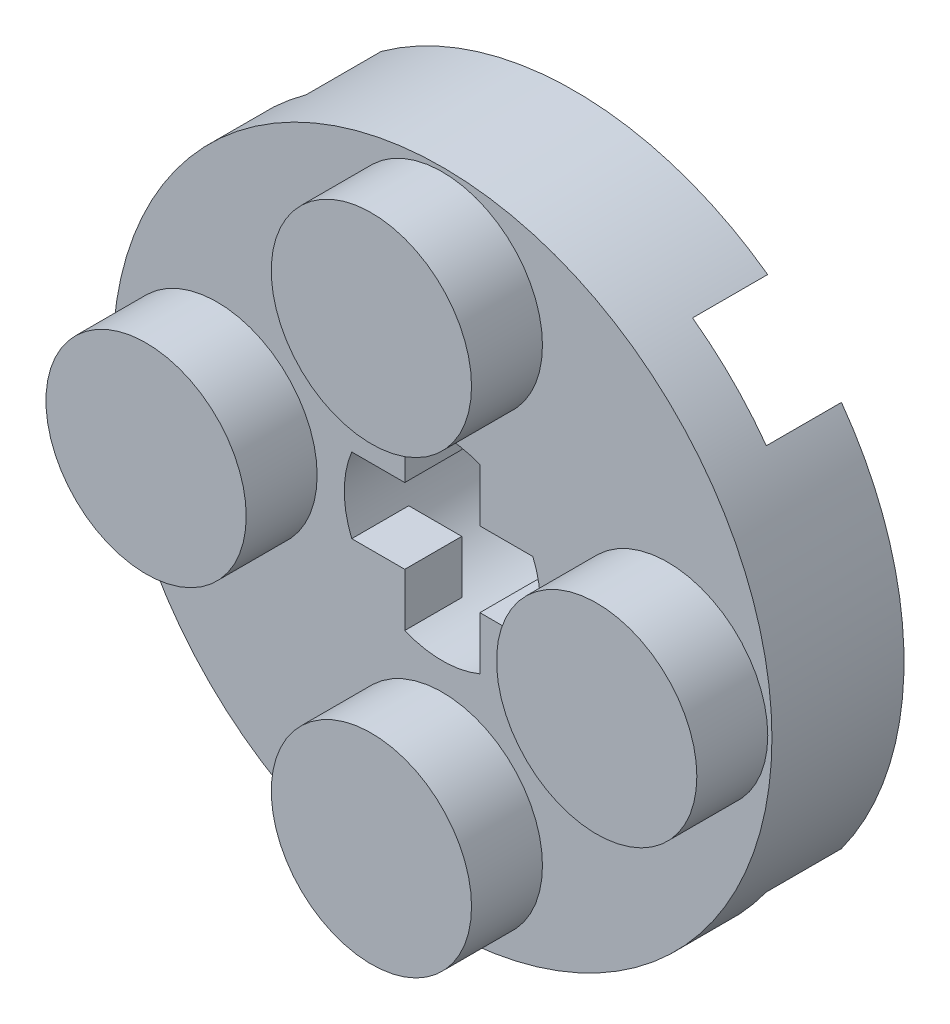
ISO-10303-21;
HEADER;
FILE_DESCRIPTION(('STEP AP214'),'2;1');
FILE_NAME('part.step','',(''),(''),'','','');
FILE_SCHEMA(('AUTOMOTIVE_DESIGN { 1 0 10303 214 1 1 1 1 }'));
ENDSEC;
DATA;
#1=APPLICATION_CONTEXT('core data for automotive mechanical design processes');
#2=APPLICATION_PROTOCOL_DEFINITION('international standard','automotive_design',2000,#1);
#3=PRODUCT_CONTEXT('',#1,'mechanical');
#4=PRODUCT('Part','Part','',(#3));
#5=PRODUCT_RELATED_PRODUCT_CATEGORY('part','',(#4));
#6=PRODUCT_DEFINITION_FORMATION('','',#4);
#7=PRODUCT_DEFINITION_CONTEXT('part definition',#1,'design');
#8=PRODUCT_DEFINITION('design','',#6,#7);
#9=PRODUCT_DEFINITION_SHAPE('','',#8);
#10=(LENGTH_UNIT() NAMED_UNIT(*) SI_UNIT(.MILLI.,.METRE.));
#11=(NAMED_UNIT(*) PLANE_ANGLE_UNIT() SI_UNIT($,.RADIAN.));
#12=(NAMED_UNIT(*) SI_UNIT($,.STERADIAN.) SOLID_ANGLE_UNIT());
#13=UNCERTAINTY_MEASURE_WITH_UNIT(LENGTH_MEASURE(1.E-05),#10,'distance_accuracy_value','');
#14=(GEOMETRIC_REPRESENTATION_CONTEXT(3) GLOBAL_UNCERTAINTY_ASSIGNED_CONTEXT((#13)) GLOBAL_UNIT_ASSIGNED_CONTEXT((#10,
#11,#12)) REPRESENTATION_CONTEXT('',''));
#15=CARTESIAN_POINT('',(0.,0.,0.));
#16=DIRECTION('',(0.,0.,1.));
#17=DIRECTION('',(1.,0.,0.));
#18=AXIS2_PLACEMENT_3D('',#15,#16,#17);
#19=CARTESIAN_POINT('',(6.4,6.4,1.8));
#20=DIRECTION('',(0.,0.,-1.));
#21=DIRECTION('',(-1.,0.,0.));
#22=AXIS2_PLACEMENT_3D('',#19,#20,#21);
#23=PLANE('',#22);
#24=CARTESIAN_POINT('',(0.,0.,1.8));
#25=DIRECTION('',(0.,0.,-1.));
#26=DIRECTION('',(-1.,0.,0.));
#27=AXIS2_PLACEMENT_3D('',#24,#25,#26);
#28=CIRCLE('',#27,7.9);
#29=CARTESIAN_POINT('',(-6.4,4.63141447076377,1.8));
#30=VERTEX_POINT('',#29);
#31=CARTESIAN_POINT('',(-4.63141447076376,6.4,1.8));
#32=VERTEX_POINT('',#31);
#33=EDGE_CURVE('E331',#30,#32,#28,.T.);
#34=ORIENTED_EDGE('',*,*,#33,.T.);
#35=DIRECTION('',(1.,0.,0.));
#36=VECTOR('',#35,1.);
#37=CARTESIAN_POINT('',(-6.4,6.4,1.8));
#38=LINE('',#37,#36);
#39=CARTESIAN_POINT('',(4.63141447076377,6.4,1.8));
#40=VERTEX_POINT('',#39);
#41=EDGE_CURVE('E257',#32,#40,#38,.T.);
#42=ORIENTED_EDGE('',*,*,#41,.T.);
#43=CARTESIAN_POINT('',(6.4,4.63141447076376,1.8));
#44=VERTEX_POINT('',#43);
#45=EDGE_CURVE('E706',#40,#44,#28,.T.);
#46=ORIENTED_EDGE('',*,*,#45,.T.);
#47=DIRECTION('',(0.,-1.,0.));
#48=VECTOR('',#47,1.);
#49=CARTESIAN_POINT('',(6.4,-6.4,1.8));
#50=LINE('',#49,#48);
#51=CARTESIAN_POINT('',(6.4,-4.63141447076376,1.8));
#52=VERTEX_POINT('',#51);
#53=EDGE_CURVE('E248',#44,#52,#50,.T.);
#54=ORIENTED_EDGE('',*,*,#53,.T.);
#55=CARTESIAN_POINT('',(4.63141447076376,-6.4,1.8));
#56=VERTEX_POINT('',#55);
#57=EDGE_CURVE('E330',#52,#56,#28,.T.);
#58=ORIENTED_EDGE('',*,*,#57,.T.);
#59=DIRECTION('',(-1.,0.,0.));
#60=VECTOR('',#59,1.);
#61=CARTESIAN_POINT('',(-6.4,-6.4,1.8));
#62=LINE('',#61,#60);
#63=CARTESIAN_POINT('',(-4.63141447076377,-6.4,1.8));
#64=VERTEX_POINT('',#63);
#65=EDGE_CURVE('E251',#56,#64,#62,.T.);
#66=ORIENTED_EDGE('',*,*,#65,.T.);
#67=CARTESIAN_POINT('',(-6.4,-4.63141447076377,1.8));
#68=VERTEX_POINT('',#67);
#69=EDGE_CURVE('E328',#64,#68,#28,.T.);
#70=ORIENTED_EDGE('',*,*,#69,.T.);
#71=DIRECTION('',(0.,1.,0.));
#72=VECTOR('',#71,1.);
#73=CARTESIAN_POINT('',(-6.4,-6.4,1.8));
#74=LINE('',#73,#72);
#75=EDGE_CURVE('E254',#68,#30,#74,.T.);
#76=ORIENTED_EDGE('',*,*,#75,.T.);
#77=EDGE_LOOP('',(#34,#42,#46,#54,#58,#66,#70,#76));
#78=FACE_BOUND('',#77,.T.);
#79=CARTESIAN_POINT('',(0.,0.,1.8));
#80=DIRECTION('',(0.,0.,-1.));
#81=DIRECTION('',(-1.,0.,0.));
#82=AXIS2_PLACEMENT_3D('',#79,#80,#81);
#83=CIRCLE('',#82,3.);
#84=CARTESIAN_POINT('',(-3.,0.,1.8));
#85=VERTEX_POINT('',#84);
#86=EDGE_CURVE('E348',#85,#85,#83,.T.);
#87=ORIENTED_EDGE('',*,*,#86,.F.);
#88=EDGE_LOOP('',(#87));
#89=FACE_BOUND('',#88,.T.);
#90=ADVANCED_FACE('F39',(#78,#89),#23,.T.);
#91=CARTESIAN_POINT('',(0.,0.,1.8));
#92=DIRECTION('',(0.,0.,-1.));
#93=DIRECTION('',(-1.,0.,0.));
#94=AXIS2_PLACEMENT_3D('',#91,#92,#93);
#95=CIRCLE('',#94,2.35);
#96=CARTESIAN_POINT('',(-0.899999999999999,-2.17082933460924,1.8));
#97=VERTEX_POINT('',#96);
#98=CARTESIAN_POINT('',(-2.17082933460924,-0.899999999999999,1.8));
#99=VERTEX_POINT('',#98);
#100=EDGE_CURVE('E191',#97,#99,#95,.T.);
#101=ORIENTED_EDGE('',*,*,#100,.T.);
#102=DIRECTION('',(-1.,0.,0.));
#103=VECTOR('',#102,1.);
#104=CARTESIAN_POINT('',(6.4,-0.899999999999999,1.8));
#105=LINE('',#104,#103);
#106=CARTESIAN_POINT('',(-0.9,-0.9,1.8));
#107=VERTEX_POINT('',#106);
#108=EDGE_CURVE('E204',#107,#99,#105,.T.);
#109=ORIENTED_EDGE('',*,*,#108,.F.);
#110=DIRECTION('',(0.,1.,0.));
#111=VECTOR('',#110,1.);
#112=CARTESIAN_POINT('',(-0.900000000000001,6.4,1.8));
#113=LINE('',#112,#111);
#114=EDGE_CURVE('E207',#97,#107,#113,.T.);
#115=ORIENTED_EDGE('',*,*,#114,.F.);
#116=EDGE_LOOP('',(#101,#109,#115));
#117=FACE_BOUND('',#116,.T.);
#118=ADVANCED_FACE('F395',(#117),#23,.T.);
#119=CARTESIAN_POINT('',(2.17082933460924,-0.9,1.8));
#120=VERTEX_POINT('',#119);
#121=CARTESIAN_POINT('',(0.9,-2.17082933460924,1.8));
#122=VERTEX_POINT('',#121);
#123=EDGE_CURVE('E225',#120,#122,#95,.T.);
#124=ORIENTED_EDGE('',*,*,#123,.T.);
#125=DIRECTION('',(0.,-1.,0.));
#126=VECTOR('',#125,1.);
#127=CARTESIAN_POINT('',(0.899999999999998,6.4,1.8));
#128=LINE('',#127,#126);
#129=CARTESIAN_POINT('',(0.9,-0.9,1.8));
#130=VERTEX_POINT('',#129);
#131=EDGE_CURVE('E47',#130,#122,#128,.T.);
#132=ORIENTED_EDGE('',*,*,#131,.F.);
#133=DIRECTION('',(-1.,0.,0.));
#134=VECTOR('',#133,1.);
#135=CARTESIAN_POINT('',(6.4,-0.9,1.8));
#136=LINE('',#135,#134);
#137=EDGE_CURVE('E11',#120,#130,#136,.T.);
#138=ORIENTED_EDGE('',*,*,#137,.F.);
#139=EDGE_LOOP('',(#124,#132,#138));
#140=FACE_BOUND('',#139,.T.);
#141=ADVANCED_FACE('F401',(#140),#23,.T.);
#142=CARTESIAN_POINT('',(0.9,2.17082933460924,1.8));
#143=VERTEX_POINT('',#142);
#144=CARTESIAN_POINT('',(2.17082933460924,0.9,1.8));
#145=VERTEX_POINT('',#144);
#146=EDGE_CURVE('E189',#143,#145,#95,.T.);
#147=ORIENTED_EDGE('',*,*,#146,.T.);
#148=DIRECTION('',(1.,0.,0.));
#149=VECTOR('',#148,1.);
#150=CARTESIAN_POINT('',(6.4,0.9,1.8));
#151=LINE('',#150,#149);
#152=CARTESIAN_POINT('',(0.9,0.9,1.8));
#153=VERTEX_POINT('',#152);
#154=EDGE_CURVE('E332',#153,#145,#151,.T.);
#155=ORIENTED_EDGE('',*,*,#154,.F.);
#156=DIRECTION('',(0.,-1.,0.));
#157=VECTOR('',#156,1.);
#158=CARTESIAN_POINT('',(0.9,6.4,1.8));
#159=LINE('',#158,#157);
#160=EDGE_CURVE('E209',#143,#153,#159,.T.);
#161=ORIENTED_EDGE('',*,*,#160,.F.);
#162=EDGE_LOOP('',(#147,#155,#161));
#163=FACE_BOUND('',#162,.T.);
#164=ADVANCED_FACE('F340',(#163),#23,.T.);
#165=CARTESIAN_POINT('',(0.,0.,0.));
#166=DIRECTION('',(0.,0.,1.));
#167=DIRECTION('',(1.,0.,0.));
#168=AXIS2_PLACEMENT_3D('',#165,#166,#167);
#169=PLANE('',#168);
#170=CARTESIAN_POINT('',(0.,0.,0.));
#171=DIRECTION('',(0.,0.,1.));
#172=DIRECTION('',(1.,0.,0.));
#173=AXIS2_PLACEMENT_3D('',#170,#171,#172);
#174=CIRCLE('',#173,7.9);
#175=CARTESIAN_POINT('',(6.4,-4.63141447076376,0.));
#176=VERTEX_POINT('',#175);
#177=CARTESIAN_POINT('',(6.4,4.63141447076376,0.));
#178=VERTEX_POINT('',#177);
#179=EDGE_CURVE('E306',#176,#178,#174,.T.);
#180=ORIENTED_EDGE('',*,*,#179,.F.);
#181=DIRECTION('',(0.,1.,0.));
#182=VECTOR('',#181,1.);
#183=CARTESIAN_POINT('',(6.4,0.,0.));
#184=LINE('',#183,#182);
#185=EDGE_CURVE('E325',#176,#178,#184,.T.);
#186=ORIENTED_EDGE('',*,*,#185,.T.);
#187=EDGE_LOOP('',(#180,#186));
#188=FACE_BOUND('',#187,.T.);
#189=ADVANCED_FACE('F420',(#188),#169,.F.);
#190=CARTESIAN_POINT('',(4.63141447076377,6.4,0.));
#191=VERTEX_POINT('',#190);
#192=CARTESIAN_POINT('',(-4.63141447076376,6.4,0.));
#193=VERTEX_POINT('',#192);
#194=EDGE_CURVE('E313',#191,#193,#174,.T.);
#195=ORIENTED_EDGE('',*,*,#194,.F.);
#196=DIRECTION('',(-1.,0.,0.));
#197=VECTOR('',#196,1.);
#198=CARTESIAN_POINT('',(0.,6.4,0.));
#199=LINE('',#198,#197);
#200=EDGE_CURVE('E322',#191,#193,#199,.T.);
#201=ORIENTED_EDGE('',*,*,#200,.T.);
#202=EDGE_LOOP('',(#195,#201));
#203=FACE_BOUND('',#202,.T.);
#204=ADVANCED_FACE('F425',(#203),#169,.F.);
#205=CARTESIAN_POINT('',(-6.4,4.63141447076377,0.));
#206=VERTEX_POINT('',#205);
#207=CARTESIAN_POINT('',(-6.4,-4.63141447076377,0.));
#208=VERTEX_POINT('',#207);
#209=EDGE_CURVE('E696',#206,#208,#174,.T.);
#210=ORIENTED_EDGE('',*,*,#209,.F.);
#211=DIRECTION('',(0.,-1.,0.));
#212=VECTOR('',#211,1.);
#213=CARTESIAN_POINT('',(-6.4,0.,0.));
#214=LINE('',#213,#212);
#215=EDGE_CURVE('E319',#206,#208,#214,.T.);
#216=ORIENTED_EDGE('',*,*,#215,.T.);
#217=EDGE_LOOP('',(#210,#216));
#218=FACE_BOUND('',#217,.T.);
#219=ADVANCED_FACE('F486',(#218),#169,.F.);
#220=CARTESIAN_POINT('',(0.,0.,3.166));
#221=DIRECTION('',(0.,0.,1.));
#222=DIRECTION('',(1.,0.,0.));
#223=AXIS2_PLACEMENT_3D('',#220,#221,#222);
#224=PLANE('',#223);
#225=CARTESIAN_POINT('',(0.,0.,3.166));
#226=DIRECTION('',(0.,0.,1.));
#227=DIRECTION('',(1.,0.,0.));
#228=AXIS2_PLACEMENT_3D('',#225,#226,#227);
#229=CIRCLE('',#228,2.35);
#230=CARTESIAN_POINT('',(2.17082933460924,-0.9,3.166));
#231=VERTEX_POINT('',#230);
#232=CARTESIAN_POINT('',(2.17082933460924,0.9,3.166));
#233=VERTEX_POINT('',#232);
#234=EDGE_CURVE('E54',#231,#233,#229,.T.);
#235=ORIENTED_EDGE('',*,*,#234,.F.);
#236=DIRECTION('',(1.,0.,0.));
#237=VECTOR('',#236,1.);
#238=CARTESIAN_POINT('',(0.9,-0.9,3.166));
#239=LINE('',#238,#237);
#240=CARTESIAN_POINT('',(0.9,-0.9,3.166));
#241=VERTEX_POINT('',#240);
#242=EDGE_CURVE('E247',#241,#231,#239,.T.);
#243=ORIENTED_EDGE('',*,*,#242,.F.);
#244=DIRECTION('',(0.,1.,0.));
#245=VECTOR('',#244,1.);
#246=CARTESIAN_POINT('',(0.9,-0.9,3.166));
#247=LINE('',#246,#245);
#248=CARTESIAN_POINT('',(0.9,-2.17082933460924,3.166));
#249=VERTEX_POINT('',#248);
#250=EDGE_CURVE('E371',#249,#241,#247,.T.);
#251=ORIENTED_EDGE('',*,*,#250,.F.);
#252=CARTESIAN_POINT('',(0.,0.,3.166));
#253=DIRECTION('',(0.,0.,1.));
#254=DIRECTION('',(1.,0.,0.));
#255=AXIS2_PLACEMENT_3D('',#252,#253,#254);
#256=CIRCLE('',#255,2.35);
#257=CARTESIAN_POINT('',(-0.899999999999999,-2.17082933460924,3.166));
#258=VERTEX_POINT('',#257);
#259=EDGE_CURVE('E228',#258,#249,#256,.T.);
#260=ORIENTED_EDGE('',*,*,#259,.F.);
#261=DIRECTION('',(0.,-1.,0.));
#262=VECTOR('',#261,1.);
#263=CARTESIAN_POINT('',(-0.9,-0.9,3.166));
#264=LINE('',#263,#262);
#265=CARTESIAN_POINT('',(-0.9,-0.9,3.166));
#266=VERTEX_POINT('',#265);
#267=EDGE_CURVE('E367',#266,#258,#264,.T.);
#268=ORIENTED_EDGE('',*,*,#267,.F.);
#269=DIRECTION('',(1.,0.,0.));
#270=VECTOR('',#269,1.);
#271=CARTESIAN_POINT('',(-2.17082933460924,-0.9,3.166));
#272=LINE('',#271,#270);
#273=CARTESIAN_POINT('',(-2.17082933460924,-0.899999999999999,3.166));
#274=VERTEX_POINT('',#273);
#275=EDGE_CURVE('E364',#274,#266,#272,.T.);
#276=ORIENTED_EDGE('',*,*,#275,.F.);
#277=CARTESIAN_POINT('',(0.,0.,3.166));
#278=DIRECTION('',(0.,0.,1.));
#279=DIRECTION('',(1.,0.,0.));
#280=AXIS2_PLACEMENT_3D('',#277,#278,#279);
#281=CIRCLE('',#280,2.35);
#282=CARTESIAN_POINT('',(-2.17082933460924,0.9,3.166));
#283=VERTEX_POINT('',#282);
#284=EDGE_CURVE('E362',#283,#274,#281,.T.);
#285=ORIENTED_EDGE('',*,*,#284,.F.);
#286=DIRECTION('',(-1.,0.,0.));
#287=VECTOR('',#286,1.);
#288=CARTESIAN_POINT('',(-2.17082933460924,0.9,3.166));
#289=LINE('',#288,#287);
#290=CARTESIAN_POINT('',(-0.9,0.9,3.166));
#291=VERTEX_POINT('',#290);
#292=EDGE_CURVE('E197',#291,#283,#289,.T.);
#293=ORIENTED_EDGE('',*,*,#292,.F.);
#294=DIRECTION('',(0.,-1.,0.));
#295=VECTOR('',#294,1.);
#296=CARTESIAN_POINT('',(-0.9,2.17082933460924,3.166));
#297=LINE('',#296,#295);
#298=CARTESIAN_POINT('',(-0.9,2.17082933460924,3.166));
#299=VERTEX_POINT('',#298);
#300=EDGE_CURVE('E358',#299,#291,#297,.T.);
#301=ORIENTED_EDGE('',*,*,#300,.F.);
#302=CARTESIAN_POINT('',(0.,0.,3.166));
#303=DIRECTION('',(0.,0.,1.));
#304=DIRECTION('',(1.,0.,0.));
#305=AXIS2_PLACEMENT_3D('',#302,#303,#304);
#306=CIRCLE('',#305,2.35);
#307=CARTESIAN_POINT('',(0.9,2.17082933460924,3.166));
#308=VERTEX_POINT('',#307);
#309=EDGE_CURVE('E356',#308,#299,#306,.T.);
#310=ORIENTED_EDGE('',*,*,#309,.F.);
#311=DIRECTION('',(0.,1.,0.));
#312=VECTOR('',#311,1.);
#313=CARTESIAN_POINT('',(0.9,2.17082933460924,3.166));
#314=LINE('',#313,#312);
#315=CARTESIAN_POINT('',(0.9,0.9,3.166));
#316=VERTEX_POINT('',#315);
#317=EDGE_CURVE('E354',#316,#308,#314,.T.);
#318=ORIENTED_EDGE('',*,*,#317,.F.);
#319=DIRECTION('',(-1.,0.,0.));
#320=VECTOR('',#319,1.);
#321=CARTESIAN_POINT('',(0.9,0.9,3.166));
#322=LINE('',#321,#320);
#323=EDGE_CURVE('E352',#233,#316,#322,.T.);
#324=ORIENTED_EDGE('',*,*,#323,.F.);
#325=EDGE_LOOP('',(#235,#243,#251,#260,#268,#276,#285,#293,#301,#310,#318,#324));
#326=FACE_BOUND('',#325,.T.);
#327=CARTESIAN_POINT('',(0.,-5.4,3.166));
#328=DIRECTION('',(0.,0.,1.));
#329=DIRECTION('',(1.,0.,0.));
#330=AXIS2_PLACEMENT_3D('',#327,#328,#329);
#331=CIRCLE('',#330,2.4);
#332=CARTESIAN_POINT('',(2.4,-5.4,3.166));
#333=VERTEX_POINT('',#332);
#334=EDGE_CURVE('E288',#333,#333,#331,.T.);
#335=ORIENTED_EDGE('',*,*,#334,.F.);
#336=EDGE_LOOP('',(#335));
#337=FACE_BOUND('',#336,.T.);
#338=CARTESIAN_POINT('',(0.,5.4,3.166));
#339=DIRECTION('',(0.,0.,1.));
#340=DIRECTION('',(1.,0.,0.));
#341=AXIS2_PLACEMENT_3D('',#338,#339,#340);
#342=CIRCLE('',#341,2.4);
#343=CARTESIAN_POINT('',(2.4,5.4,3.166));
#344=VERTEX_POINT('',#343);
#345=EDGE_CURVE('E300',#344,#344,#342,.T.);
#346=ORIENTED_EDGE('',*,*,#345,.F.);
#347=EDGE_LOOP('',(#346));
#348=FACE_BOUND('',#347,.T.);
#349=CARTESIAN_POINT('',(0.,0.,3.166));
#350=DIRECTION('',(0.,0.,1.));
#351=DIRECTION('',(1.,0.,0.));
#352=AXIS2_PLACEMENT_3D('',#349,#350,#351);
#353=CIRCLE('',#352,7.9);
#354=CARTESIAN_POINT('',(7.9,0.,3.166));
#355=VERTEX_POINT('',#354);
#356=EDGE_CURVE('E309',#355,#355,#353,.T.);
#357=ORIENTED_EDGE('',*,*,#356,.T.);
#358=EDGE_LOOP('',(#357));
#359=FACE_BOUND('',#358,.T.);
#360=CARTESIAN_POINT('',(5.4,0.,3.166));
#361=DIRECTION('',(0.,0.,1.));
#362=DIRECTION('',(1.,0.,0.));
#363=AXIS2_PLACEMENT_3D('',#360,#361,#362);
#364=CIRCLE('',#363,2.4);
#365=CARTESIAN_POINT('',(7.8,0.,3.166));
#366=VERTEX_POINT('',#365);
#367=EDGE_CURVE('E294',#366,#366,#364,.T.);
#368=ORIENTED_EDGE('',*,*,#367,.F.);
#369=EDGE_LOOP('',(#368));
#370=FACE_BOUND('',#369,.T.);
#371=CARTESIAN_POINT('',(-5.4,0.,3.166));
#372=DIRECTION('',(0.,0.,1.));
#373=DIRECTION('',(1.,0.,0.));
#374=AXIS2_PLACEMENT_3D('',#371,#372,#373);
#375=CIRCLE('',#374,2.4);
#376=CARTESIAN_POINT('',(-3.,0.,3.166));
#377=VERTEX_POINT('',#376);
#378=EDGE_CURVE('E284',#377,#377,#375,.T.);
#379=ORIENTED_EDGE('',*,*,#378,.F.);
#380=EDGE_LOOP('',(#379));
#381=FACE_BOUND('',#380,.T.);
#382=ADVANCED_FACE('F378',(#326,#337,#348,#359,#370,#381),#224,.T.);
#383=CARTESIAN_POINT('',(0.,0.,3.166));
#384=DIRECTION('',(0.,0.,-1.));
#385=DIRECTION('',(-1.,0.,0.));
#386=AXIS2_PLACEMENT_3D('',#383,#384,#385);
#387=CYLINDRICAL_SURFACE('',#386,7.9);
#388=ORIENTED_EDGE('',*,*,#194,.T.);
#389=DIRECTION('',(0.,0.,-1.));
#390=VECTOR('',#389,1.);
#391=CARTESIAN_POINT('',(-4.63141447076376,6.4,3.166));
#392=LINE('',#391,#390);
#393=EDGE_CURVE('E272',#193,#32,#392,.F.);
#394=ORIENTED_EDGE('',*,*,#393,.T.);
#395=ORIENTED_EDGE('',*,*,#33,.F.);
#396=DIRECTION('',(0.,0.,-1.));
#397=VECTOR('',#396,1.);
#398=CARTESIAN_POINT('',(-6.4,4.63141447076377,3.166));
#399=LINE('',#398,#397);
#400=EDGE_CURVE('E269',#30,#206,#399,.T.);
#401=ORIENTED_EDGE('',*,*,#400,.T.);
#402=ORIENTED_EDGE('',*,*,#209,.T.);
#403=DIRECTION('',(0.,0.,-1.));
#404=VECTOR('',#403,1.);
#405=CARTESIAN_POINT('',(-6.4,-4.63141447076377,3.166));
#406=LINE('',#405,#404);
#407=EDGE_CURVE('E266',#208,#68,#406,.F.);
#408=ORIENTED_EDGE('',*,*,#407,.T.);
#409=ORIENTED_EDGE('',*,*,#69,.F.);
#410=DIRECTION('',(0.,0.,-1.));
#411=VECTOR('',#410,1.);
#412=CARTESIAN_POINT('',(-4.63141447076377,-6.4,3.166));
#413=LINE('',#412,#411);
#414=CARTESIAN_POINT('',(-4.63141447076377,-6.4,0.));
#415=VERTEX_POINT('',#414);
#416=EDGE_CURVE('E263',#64,#415,#413,.T.);
#417=ORIENTED_EDGE('',*,*,#416,.T.);
#418=CARTESIAN_POINT('',(4.63141447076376,-6.4,0.));
#419=VERTEX_POINT('',#418);
#420=EDGE_CURVE('E316',#415,#419,#174,.T.);
#421=ORIENTED_EDGE('',*,*,#420,.T.);
#422=DIRECTION('',(0.,0.,-1.));
#423=VECTOR('',#422,1.);
#424=CARTESIAN_POINT('',(4.63141447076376,-6.4,3.166));
#425=LINE('',#424,#423);
#426=EDGE_CURVE('E260',#419,#56,#425,.F.);
#427=ORIENTED_EDGE('',*,*,#426,.T.);
#428=ORIENTED_EDGE('',*,*,#57,.F.);
#429=DIRECTION('',(0.,0.,-1.));
#430=VECTOR('',#429,1.);
#431=CARTESIAN_POINT('',(6.4,-4.63141447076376,3.166));
#432=LINE('',#431,#430);
#433=EDGE_CURVE('E281',#52,#176,#432,.T.);
#434=ORIENTED_EDGE('',*,*,#433,.T.);
#435=ORIENTED_EDGE('',*,*,#179,.T.);
#436=DIRECTION('',(0.,0.,-1.));
#437=VECTOR('',#436,1.);
#438=CARTESIAN_POINT('',(6.4,4.63141447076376,3.166));
#439=LINE('',#438,#437);
#440=EDGE_CURVE('E278',#178,#44,#439,.F.);
#441=ORIENTED_EDGE('',*,*,#440,.T.);
#442=ORIENTED_EDGE('',*,*,#45,.F.);
#443=DIRECTION('',(0.,0.,-1.));
#444=VECTOR('',#443,1.);
#445=CARTESIAN_POINT('',(4.63141447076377,6.4,3.166));
#446=LINE('',#445,#444);
#447=EDGE_CURVE('E275',#40,#191,#446,.T.);
#448=ORIENTED_EDGE('',*,*,#447,.T.);
#449=EDGE_LOOP('',(#388,#394,#395,#401,#402,#408,#409,#417,#421,#427,#428,#434,#435,#441,#442,#448));
#450=FACE_BOUND('',#449,.T.);
#451=ORIENTED_EDGE('',*,*,#356,.F.);
#452=EDGE_LOOP('',(#451));
#453=FACE_BOUND('',#452,.T.);
#454=ADVANCED_FACE('F41',(#450,#453),#387,.T.);
#455=ORIENTED_EDGE('',*,*,#420,.F.);
#456=DIRECTION('',(1.,0.,0.));
#457=VECTOR('',#456,1.);
#458=CARTESIAN_POINT('',(0.,-6.4,0.));
#459=LINE('',#458,#457);
#460=EDGE_CURVE('E312',#415,#419,#459,.T.);
#461=ORIENTED_EDGE('',*,*,#460,.T.);
#462=EDGE_LOOP('',(#455,#461));
#463=FACE_BOUND('',#462,.T.);
#464=ADVANCED_FACE('F427',(#463),#169,.F.);
#465=CARTESIAN_POINT('',(0.,5.4,4.866));
#466=DIRECTION('',(0.,0.,-1.));
#467=DIRECTION('',(-1.,0.,0.));
#468=AXIS2_PLACEMENT_3D('',#465,#466,#467);
#469=CYLINDRICAL_SURFACE('',#468,2.4);
#470=CARTESIAN_POINT('',(0.,5.4,4.866));
#471=DIRECTION('',(0.,0.,1.));
#472=DIRECTION('',(1.,0.,0.));
#473=AXIS2_PLACEMENT_3D('',#470,#471,#472);
#474=CIRCLE('',#473,2.4);
#475=CARTESIAN_POINT('',(2.4,5.4,4.866));
#476=VERTEX_POINT('',#475);
#477=EDGE_CURVE('E303',#476,#476,#474,.T.);
#478=ORIENTED_EDGE('',*,*,#477,.F.);
#479=EDGE_LOOP('',(#478));
#480=FACE_BOUND('',#479,.T.);
#481=ORIENTED_EDGE('',*,*,#345,.T.);
#482=EDGE_LOOP('',(#481));
#483=FACE_BOUND('',#482,.T.);
#484=ADVANCED_FACE('F587',(#480,#483),#469,.T.);
#485=CARTESIAN_POINT('',(0.,5.4,4.866));
#486=DIRECTION('',(0.,0.,1.));
#487=DIRECTION('',(1.,0.,0.));
#488=AXIS2_PLACEMENT_3D('',#485,#486,#487);
#489=PLANE('',#488);
#490=ORIENTED_EDGE('',*,*,#477,.T.);
#491=EDGE_LOOP('',(#490));
#492=FACE_BOUND('',#491,.T.);
#493=ADVANCED_FACE('F578',(#492),#489,.T.);
#494=CARTESIAN_POINT('',(5.4,0.,4.866));
#495=DIRECTION('',(0.,0.,-1.));
#496=DIRECTION('',(-1.,0.,0.));
#497=AXIS2_PLACEMENT_3D('',#494,#495,#496);
#498=CYLINDRICAL_SURFACE('',#497,2.4);
#499=CARTESIAN_POINT('',(5.4,0.,4.866));
#500=DIRECTION('',(0.,0.,1.));
#501=DIRECTION('',(1.,0.,0.));
#502=AXIS2_PLACEMENT_3D('',#499,#500,#501);
#503=CIRCLE('',#502,2.4);
#504=CARTESIAN_POINT('',(7.8,0.,4.866));
#505=VERTEX_POINT('',#504);
#506=EDGE_CURVE('E297',#505,#505,#503,.T.);
#507=ORIENTED_EDGE('',*,*,#506,.F.);
#508=EDGE_LOOP('',(#507));
#509=FACE_BOUND('',#508,.T.);
#510=ORIENTED_EDGE('',*,*,#367,.T.);
#511=EDGE_LOOP('',(#510));
#512=FACE_BOUND('',#511,.T.);
#513=ADVANCED_FACE('F571',(#509,#512),#498,.T.);
#514=CARTESIAN_POINT('',(5.4,0.,4.866));
#515=DIRECTION('',(0.,0.,1.));
#516=DIRECTION('',(1.,0.,0.));
#517=AXIS2_PLACEMENT_3D('',#514,#515,#516);
#518=PLANE('',#517);
#519=ORIENTED_EDGE('',*,*,#506,.T.);
#520=EDGE_LOOP('',(#519));
#521=FACE_BOUND('',#520,.T.);
#522=ADVANCED_FACE('F577',(#521),#518,.T.);
#523=CARTESIAN_POINT('',(0.,-5.4,4.866));
#524=DIRECTION('',(0.,0.,-1.));
#525=DIRECTION('',(-1.,0.,0.));
#526=AXIS2_PLACEMENT_3D('',#523,#524,#525);
#527=CYLINDRICAL_SURFACE('',#526,2.4);
#528=CARTESIAN_POINT('',(0.,-5.4,4.866));
#529=DIRECTION('',(0.,0.,1.));
#530=DIRECTION('',(1.,0.,0.));
#531=AXIS2_PLACEMENT_3D('',#528,#529,#530);
#532=CIRCLE('',#531,2.4);
#533=CARTESIAN_POINT('',(2.4,-5.4,4.866));
#534=VERTEX_POINT('',#533);
#535=EDGE_CURVE('E291',#534,#534,#532,.T.);
#536=ORIENTED_EDGE('',*,*,#535,.F.);
#537=EDGE_LOOP('',(#536));
#538=FACE_BOUND('',#537,.T.);
#539=ORIENTED_EDGE('',*,*,#334,.T.);
#540=EDGE_LOOP('',(#539));
#541=FACE_BOUND('',#540,.T.);
#542=ADVANCED_FACE('F598',(#538,#541),#527,.T.);
#543=CARTESIAN_POINT('',(0.,-5.4,4.866));
#544=DIRECTION('',(0.,0.,1.));
#545=DIRECTION('',(1.,0.,0.));
#546=AXIS2_PLACEMENT_3D('',#543,#544,#545);
#547=PLANE('',#546);
#548=ORIENTED_EDGE('',*,*,#535,.T.);
#549=EDGE_LOOP('',(#548));
#550=FACE_BOUND('',#549,.T.);
#551=ADVANCED_FACE('F604',(#550),#547,.T.);
#552=CARTESIAN_POINT('',(-5.4,0.,4.866));
#553=DIRECTION('',(0.,0.,-1.));
#554=DIRECTION('',(-1.,0.,0.));
#555=AXIS2_PLACEMENT_3D('',#552,#553,#554);
#556=CYLINDRICAL_SURFACE('',#555,2.4);
#557=CARTESIAN_POINT('',(-5.4,0.,4.866));
#558=DIRECTION('',(0.,0.,1.));
#559=DIRECTION('',(1.,0.,0.));
#560=AXIS2_PLACEMENT_3D('',#557,#558,#559);
#561=CIRCLE('',#560,2.4);
#562=CARTESIAN_POINT('',(-3.,0.,4.866));
#563=VERTEX_POINT('',#562);
#564=EDGE_CURVE('E285',#563,#563,#561,.T.);
#565=ORIENTED_EDGE('',*,*,#564,.F.);
#566=EDGE_LOOP('',(#565));
#567=FACE_BOUND('',#566,.T.);
#568=ORIENTED_EDGE('',*,*,#378,.T.);
#569=EDGE_LOOP('',(#568));
#570=FACE_BOUND('',#569,.T.);
#571=ADVANCED_FACE('F416',(#567,#570),#556,.T.);
#572=CARTESIAN_POINT('',(-5.4,0.,4.866));
#573=DIRECTION('',(0.,0.,1.));
#574=DIRECTION('',(1.,0.,0.));
#575=AXIS2_PLACEMENT_3D('',#572,#573,#574);
#576=PLANE('',#575);
#577=ORIENTED_EDGE('',*,*,#564,.T.);
#578=EDGE_LOOP('',(#577));
#579=FACE_BOUND('',#578,.T.);
#580=ADVANCED_FACE('F408',(#579),#576,.T.);
#581=CARTESIAN_POINT('',(-2.17082933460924,0.9,1.8));
#582=VERTEX_POINT('',#581);
#583=CARTESIAN_POINT('',(-0.9,2.17082933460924,1.8));
#584=VERTEX_POINT('',#583);
#585=EDGE_CURVE('E175',#582,#584,#95,.T.);
#586=ORIENTED_EDGE('',*,*,#585,.T.);
#587=DIRECTION('',(0.,1.,0.));
#588=VECTOR('',#587,1.);
#589=CARTESIAN_POINT('',(-0.900000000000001,6.4,1.8));
#590=LINE('',#589,#588);
#591=CARTESIAN_POINT('',(-0.9,0.9,1.8));
#592=VERTEX_POINT('',#591);
#593=EDGE_CURVE('E203',#592,#584,#590,.T.);
#594=ORIENTED_EDGE('',*,*,#593,.F.);
#595=DIRECTION('',(1.,0.,0.));
#596=VECTOR('',#595,1.);
#597=CARTESIAN_POINT('',(6.4,0.9,1.8));
#598=LINE('',#597,#596);
#599=EDGE_CURVE('E194',#582,#592,#598,.T.);
#600=ORIENTED_EDGE('',*,*,#599,.F.);
#601=EDGE_LOOP('',(#586,#594,#600));
#602=FACE_BOUND('',#601,.T.);
#603=ADVANCED_FACE('F202',(#602),#23,.T.);
#604=CARTESIAN_POINT('',(6.4,-6.4,1.8));
#605=DIRECTION('',(1.,0.,0.));
#606=DIRECTION('',(0.,0.,-1.));
#607=AXIS2_PLACEMENT_3D('',#604,#605,#606);
#608=PLANE('',#607);
#609=ORIENTED_EDGE('',*,*,#53,.F.);
#610=ORIENTED_EDGE('',*,*,#440,.F.);
#611=ORIENTED_EDGE('',*,*,#185,.F.);
#612=ORIENTED_EDGE('',*,*,#433,.F.);
#613=EDGE_LOOP('',(#609,#610,#611,#612));
#614=FACE_BOUND('',#613,.T.);
#615=ADVANCED_FACE('F407',(#614),#608,.F.);
#616=CARTESIAN_POINT('',(-6.4,6.4,1.8));
#617=DIRECTION('',(0.,1.,0.));
#618=DIRECTION('',(-1.,0.,0.));
#619=AXIS2_PLACEMENT_3D('',#616,#617,#618);
#620=PLANE('',#619);
#621=ORIENTED_EDGE('',*,*,#41,.F.);
#622=ORIENTED_EDGE('',*,*,#393,.F.);
#623=ORIENTED_EDGE('',*,*,#200,.F.);
#624=ORIENTED_EDGE('',*,*,#447,.F.);
#625=EDGE_LOOP('',(#621,#622,#623,#624));
#626=FACE_BOUND('',#625,.T.);
#627=ADVANCED_FACE('F413',(#626),#620,.F.);
#628=CARTESIAN_POINT('',(-6.4,-6.4,1.8));
#629=DIRECTION('',(-1.,0.,0.));
#630=DIRECTION('',(0.,0.,1.));
#631=AXIS2_PLACEMENT_3D('',#628,#629,#630);
#632=PLANE('',#631);
#633=ORIENTED_EDGE('',*,*,#75,.F.);
#634=ORIENTED_EDGE('',*,*,#407,.F.);
#635=ORIENTED_EDGE('',*,*,#215,.F.);
#636=ORIENTED_EDGE('',*,*,#400,.F.);
#637=EDGE_LOOP('',(#633,#634,#635,#636));
#638=FACE_BOUND('',#637,.T.);
#639=ADVANCED_FACE('F443',(#638),#632,.F.);
#640=CARTESIAN_POINT('',(-6.4,-6.4,1.8));
#641=DIRECTION('',(0.,-1.,0.));
#642=DIRECTION('',(1.,0.,0.));
#643=AXIS2_PLACEMENT_3D('',#640,#641,#642);
#644=PLANE('',#643);
#645=ORIENTED_EDGE('',*,*,#65,.F.);
#646=ORIENTED_EDGE('',*,*,#426,.F.);
#647=ORIENTED_EDGE('',*,*,#460,.F.);
#648=ORIENTED_EDGE('',*,*,#416,.F.);
#649=EDGE_LOOP('',(#645,#646,#647,#648));
#650=FACE_BOUND('',#649,.T.);
#651=ADVANCED_FACE('F439',(#650),#644,.F.);
#652=CARTESIAN_POINT('',(0.,0.,0.));
#653=DIRECTION('',(0.,0.,1.));
#654=DIRECTION('',(1.,0.,0.));
#655=AXIS2_PLACEMENT_3D('',#652,#653,#654);
#656=CYLINDRICAL_SURFACE('',#655,2.35);
#657=DIRECTION('',(0.,0.,1.));
#658=VECTOR('',#657,1.);
#659=CARTESIAN_POINT('',(2.17082933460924,0.9,0.));
#660=LINE('',#659,#658);
#661=EDGE_CURVE('E245',#145,#233,#660,.T.);
#662=ORIENTED_EDGE('',*,*,#661,.F.);
#663=ORIENTED_EDGE('',*,*,#146,.F.);
#664=DIRECTION('',(0.,0.,1.));
#665=VECTOR('',#664,1.);
#666=CARTESIAN_POINT('',(0.9,2.17082933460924,0.));
#667=LINE('',#666,#665);
#668=EDGE_CURVE('E242',#143,#308,#667,.T.);
#669=ORIENTED_EDGE('',*,*,#668,.T.);
#670=ORIENTED_EDGE('',*,*,#309,.T.);
#671=DIRECTION('',(0.,0.,1.));
#672=VECTOR('',#671,1.);
#673=CARTESIAN_POINT('',(-0.9,2.17082933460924,0.));
#674=LINE('',#673,#672);
#675=EDGE_CURVE('E183',#584,#299,#674,.T.);
#676=ORIENTED_EDGE('',*,*,#675,.F.);
#677=ORIENTED_EDGE('',*,*,#585,.F.);
#678=DIRECTION('',(0.,0.,1.));
#679=VECTOR('',#678,1.);
#680=CARTESIAN_POINT('',(-2.17082933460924,0.9,0.));
#681=LINE('',#680,#679);
#682=EDGE_CURVE('E180',#582,#283,#681,.T.);
#683=ORIENTED_EDGE('',*,*,#682,.T.);
#684=ORIENTED_EDGE('',*,*,#284,.T.);
#685=DIRECTION('',(0.,0.,1.));
#686=VECTOR('',#685,1.);
#687=CARTESIAN_POINT('',(-2.17082933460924,-0.899999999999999,0.));
#688=LINE('',#687,#686);
#689=EDGE_CURVE('E199',#99,#274,#688,.T.);
#690=ORIENTED_EDGE('',*,*,#689,.F.);
#691=ORIENTED_EDGE('',*,*,#100,.F.);
#692=DIRECTION('',(0.,0.,1.));
#693=VECTOR('',#692,1.);
#694=CARTESIAN_POINT('',(-0.899999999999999,-2.17082933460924,0.));
#695=LINE('',#694,#693);
#696=EDGE_CURVE('E230',#97,#258,#695,.T.);
#697=ORIENTED_EDGE('',*,*,#696,.T.);
#698=ORIENTED_EDGE('',*,*,#259,.T.);
#699=DIRECTION('',(0.,0.,1.));
#700=VECTOR('',#699,1.);
#701=CARTESIAN_POINT('',(0.9,-2.17082933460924,0.));
#702=LINE('',#701,#700);
#703=EDGE_CURVE('E220',#122,#249,#702,.T.);
#704=ORIENTED_EDGE('',*,*,#703,.F.);
#705=ORIENTED_EDGE('',*,*,#123,.F.);
#706=DIRECTION('',(0.,0.,1.));
#707=VECTOR('',#706,1.);
#708=CARTESIAN_POINT('',(2.17082933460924,-0.9,0.));
#709=LINE('',#708,#707);
#710=EDGE_CURVE('E232',#120,#231,#709,.T.);
#711=ORIENTED_EDGE('',*,*,#710,.T.);
#712=ORIENTED_EDGE('',*,*,#234,.T.);
#713=EDGE_LOOP('',(#662,#663,#669,#670,#676,#677,#683,#684,#690,#691,#697,#698,#704,#705,#711,#712));
#714=FACE_BOUND('',#713,.T.);
#715=CARTESIAN_POINT('',(0.,0.,0.));
#716=DIRECTION('',(0.,0.,-1.));
#717=DIRECTION('',(-1.,0.,0.));
#718=AXIS2_PLACEMENT_3D('',#715,#716,#717);
#719=CIRCLE('',#718,2.35);
#720=CARTESIAN_POINT('',(-2.35,0.,0.));
#721=VERTEX_POINT('',#720);
#722=EDGE_CURVE('E188',#721,#721,#719,.T.);
#723=ORIENTED_EDGE('',*,*,#722,.T.);
#724=EDGE_LOOP('',(#723));
#725=FACE_BOUND('',#724,.T.);
#726=ADVANCED_FACE('F177',(#714,#725),#656,.F.);
#727=CARTESIAN_POINT('',(0.9,-0.9,0.));
#728=DIRECTION('',(0.,-1.,0.));
#729=DIRECTION('',(0.,0.,-1.));
#730=AXIS2_PLACEMENT_3D('',#727,#728,#729);
#731=PLANE('',#730);
#732=ORIENTED_EDGE('',*,*,#137,.T.);
#733=DIRECTION('',(0.,0.,1.));
#734=VECTOR('',#733,1.);
#735=CARTESIAN_POINT('',(0.9,-0.9,0.));
#736=LINE('',#735,#734);
#737=EDGE_CURVE('E222',#130,#241,#736,.T.);
#738=ORIENTED_EDGE('',*,*,#737,.T.);
#739=ORIENTED_EDGE('',*,*,#242,.T.);
#740=ORIENTED_EDGE('',*,*,#710,.F.);
#741=EDGE_LOOP('',(#732,#738,#739,#740));
#742=FACE_BOUND('',#741,.T.);
#743=ADVANCED_FACE('F376',(#742),#731,.F.);
#744=CARTESIAN_POINT('',(0.9,-0.9,0.));
#745=DIRECTION('',(1.,0.,0.));
#746=DIRECTION('',(0.,1.,0.));
#747=AXIS2_PLACEMENT_3D('',#744,#745,#746);
#748=PLANE('',#747);
#749=ORIENTED_EDGE('',*,*,#131,.T.);
#750=ORIENTED_EDGE('',*,*,#703,.T.);
#751=ORIENTED_EDGE('',*,*,#250,.T.);
#752=ORIENTED_EDGE('',*,*,#737,.F.);
#753=EDGE_LOOP('',(#749,#750,#751,#752));
#754=FACE_BOUND('',#753,.T.);
#755=ADVANCED_FACE('F218',(#754),#748,.F.);
#756=CARTESIAN_POINT('',(-0.9,-0.9,0.));
#757=DIRECTION('',(-1.,0.,0.));
#758=DIRECTION('',(0.,-1.,0.));
#759=AXIS2_PLACEMENT_3D('',#756,#757,#758);
#760=PLANE('',#759);
#761=ORIENTED_EDGE('',*,*,#114,.T.);
#762=DIRECTION('',(0.,0.,1.));
#763=VECTOR('',#762,1.);
#764=CARTESIAN_POINT('',(-0.9,-0.9,0.));
#765=LINE('',#764,#763);
#766=EDGE_CURVE('E234',#107,#266,#765,.T.);
#767=ORIENTED_EDGE('',*,*,#766,.T.);
#768=ORIENTED_EDGE('',*,*,#267,.T.);
#769=ORIENTED_EDGE('',*,*,#696,.F.);
#770=EDGE_LOOP('',(#761,#767,#768,#769));
#771=FACE_BOUND('',#770,.T.);
#772=ADVANCED_FACE('F501',(#771),#760,.F.);
#773=CARTESIAN_POINT('',(-2.17082933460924,-0.9,0.));
#774=DIRECTION('',(0.,-1.,0.));
#775=DIRECTION('',(1.,0.,0.));
#776=AXIS2_PLACEMENT_3D('',#773,#774,#775);
#777=PLANE('',#776);
#778=ORIENTED_EDGE('',*,*,#108,.T.);
#779=ORIENTED_EDGE('',*,*,#689,.T.);
#780=ORIENTED_EDGE('',*,*,#275,.T.);
#781=ORIENTED_EDGE('',*,*,#766,.F.);
#782=EDGE_LOOP('',(#778,#779,#780,#781));
#783=FACE_BOUND('',#782,.T.);
#784=ADVANCED_FACE('F392',(#783),#777,.F.);
#785=CARTESIAN_POINT('',(-2.17082933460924,0.9,0.));
#786=DIRECTION('',(0.,1.,0.));
#787=DIRECTION('',(0.,0.,1.));
#788=AXIS2_PLACEMENT_3D('',#785,#786,#787);
#789=PLANE('',#788);
#790=ORIENTED_EDGE('',*,*,#599,.T.);
#791=DIRECTION('',(0.,0.,1.));
#792=VECTOR('',#791,1.);
#793=CARTESIAN_POINT('',(-0.9,0.9,0.));
#794=LINE('',#793,#792);
#795=EDGE_CURVE('E200',#592,#291,#794,.T.);
#796=ORIENTED_EDGE('',*,*,#795,.T.);
#797=ORIENTED_EDGE('',*,*,#292,.T.);
#798=ORIENTED_EDGE('',*,*,#682,.F.);
#799=EDGE_LOOP('',(#790,#796,#797,#798));
#800=FACE_BOUND('',#799,.T.);
#801=ADVANCED_FACE('F193',(#800),#789,.F.);
#802=CARTESIAN_POINT('',(-0.9,2.17082933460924,0.));
#803=DIRECTION('',(-1.,0.,0.));
#804=DIRECTION('',(0.,-1.,0.));
#805=AXIS2_PLACEMENT_3D('',#802,#803,#804);
#806=PLANE('',#805);
#807=ORIENTED_EDGE('',*,*,#593,.T.);
#808=ORIENTED_EDGE('',*,*,#675,.T.);
#809=ORIENTED_EDGE('',*,*,#300,.T.);
#810=ORIENTED_EDGE('',*,*,#795,.F.);
#811=EDGE_LOOP('',(#807,#808,#809,#810));
#812=FACE_BOUND('',#811,.T.);
#813=ADVANCED_FACE('F384',(#812),#806,.F.);
#814=CARTESIAN_POINT('',(0.9,2.17082933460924,0.));
#815=DIRECTION('',(1.,0.,0.));
#816=DIRECTION('',(0.,1.,0.));
#817=AXIS2_PLACEMENT_3D('',#814,#815,#816);
#818=PLANE('',#817);
#819=ORIENTED_EDGE('',*,*,#160,.T.);
#820=DIRECTION('',(0.,0.,1.));
#821=VECTOR('',#820,1.);
#822=CARTESIAN_POINT('',(0.9,0.9,0.));
#823=LINE('',#822,#821);
#824=EDGE_CURVE('E62',#153,#316,#823,.T.);
#825=ORIENTED_EDGE('',*,*,#824,.T.);
#826=ORIENTED_EDGE('',*,*,#317,.T.);
#827=ORIENTED_EDGE('',*,*,#668,.F.);
#828=EDGE_LOOP('',(#819,#825,#826,#827));
#829=FACE_BOUND('',#828,.T.);
#830=ADVANCED_FACE('F337',(#829),#818,.F.);
#831=CARTESIAN_POINT('',(0.9,0.9,0.));
#832=DIRECTION('',(0.,1.,0.));
#833=DIRECTION('',(0.,0.,1.));
#834=AXIS2_PLACEMENT_3D('',#831,#832,#833);
#835=PLANE('',#834);
#836=ORIENTED_EDGE('',*,*,#154,.T.);
#837=ORIENTED_EDGE('',*,*,#661,.T.);
#838=ORIENTED_EDGE('',*,*,#323,.T.);
#839=ORIENTED_EDGE('',*,*,#824,.F.);
#840=EDGE_LOOP('',(#836,#837,#838,#839));
#841=FACE_BOUND('',#840,.T.);
#842=ADVANCED_FACE('F341',(#841),#835,.F.);
#843=CARTESIAN_POINT('',(0.,0.,0.));
#844=DIRECTION('',(0.,0.,-1.));
#845=DIRECTION('',(-1.,0.,0.));
#846=AXIS2_PLACEMENT_3D('',#843,#844,#845);
#847=PLANE('',#846);
#848=CARTESIAN_POINT('',(0.,0.,0.));
#849=DIRECTION('',(0.,0.,-1.));
#850=DIRECTION('',(-1.,0.,0.));
#851=AXIS2_PLACEMENT_3D('',#848,#849,#850);
#852=CIRCLE('',#851,3.);
#853=CARTESIAN_POINT('',(-3.,0.,0.));
#854=VERTEX_POINT('',#853);
#855=EDGE_CURVE('E345',#854,#854,#852,.T.);
#856=ORIENTED_EDGE('',*,*,#855,.T.);
#857=EDGE_LOOP('',(#856));
#858=FACE_BOUND('',#857,.T.);
#859=ORIENTED_EDGE('',*,*,#722,.F.);
#860=EDGE_LOOP('',(#859));
#861=FACE_BOUND('',#860,.T.);
#862=ADVANCED_FACE('F468',(#858,#861),#847,.T.);
#863=CARTESIAN_POINT('',(0.,0.,0.));
#864=DIRECTION('',(0.,0.,1.));
#865=DIRECTION('',(1.,0.,0.));
#866=AXIS2_PLACEMENT_3D('',#863,#864,#865);
#867=CYLINDRICAL_SURFACE('',#866,3.);
#868=ORIENTED_EDGE('',*,*,#855,.F.);
#869=EDGE_LOOP('',(#868));
#870=FACE_BOUND('',#869,.T.);
#871=ORIENTED_EDGE('',*,*,#86,.T.);
#872=EDGE_LOOP('',(#871));
#873=FACE_BOUND('',#872,.T.);
#874=ADVANCED_FACE('F464',(#870,#873),#867,.T.);
#875=CLOSED_SHELL('',(#90,#118,#141,#164,#189,#204,#219,#382,#454,#464,#484,#493,#513,#522,#542,
#551,#571,#580,#603,#615,#627,#639,#651,#726,#743,#755,#772,#784,#801,#813,#830,#842,#862,#874));
#876=MANIFOLD_SOLID_BREP('B2',#875);
#877=ADVANCED_BREP_SHAPE_REPRESENTATION('',(#18,#876),#14);
#878=SHAPE_DEFINITION_REPRESENTATION(#9,#877);
ENDSEC;
END-ISO-10303-21;
